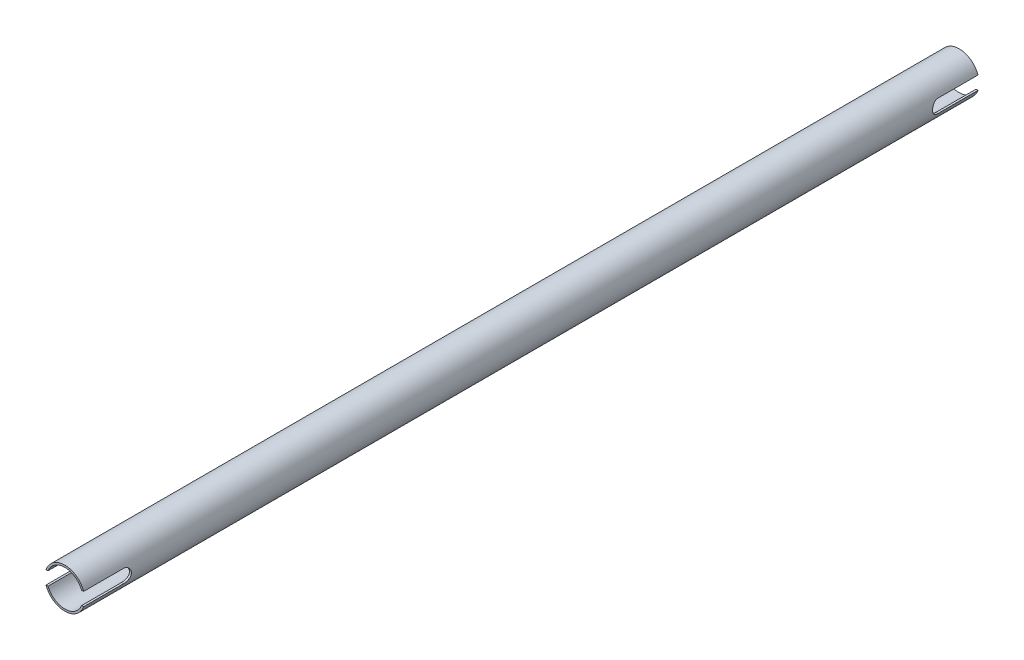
from build123d import *

# Parameters (mm, degrees)
SKETCH1_R               = 9.525
SKETCH1_R_2             = 8.61314
EXTRUDE_THIN1_DEPTH     = 426.588936
CUT_EXTRUDE1_DEPTH      = 427.80155994
CUT_EXTRUDE1_DEPTH_BACK = 427.80155994


with BuildPart() as part:
    # Sketch1 → Extrude-Thin1 (new body)
    with BuildSketch(Plane.XY):
        Circle(SKETCH1_R)
        Circle(SKETCH1_R_2, mode=Mode.SUBTRACT)
    extrude(amount=EXTRUDE_THIN1_DEPTH)

    # Sketch2 → Cut-Extrude1 (cut, two sides: drawn at the far end of the back side and taken through both)
    with BuildSketch(Plane(origin=(0, 0, 0), x_dir=(0, 0, -1), z_dir=(1, 0, 0)).offset(-CUT_EXTRUDE1_DEPTH_BACK)):
        with BuildLine():
            Line((-426.588936, 3.175), (-407.538936, 3.175))
            ThreePointArc((-407.538936, 3.175), (-404.363936, 0), (-407.538936, -3.175))
            Line((-407.538936, -3.175), (-426.588936, -3.175))
            Line((-426.588936, -3.175), (-426.588936, 3.175))
        make_face()
        with BuildLine():
            Line((0, -3.175), (-19.05, -3.175))
            ThreePointArc((-19.05, -3.175), (-22.225, 0), (-19.05, 3.175))
            Line((-19.05, 3.175), (0, 3.175))
            Line((0, 3.175), (0, -3.175))
        make_face()
    extrude(amount=CUT_EXTRUDE1_DEPTH + CUT_EXTRUDE1_DEPTH_BACK, mode=Mode.SUBTRACT)


solid = part.part
